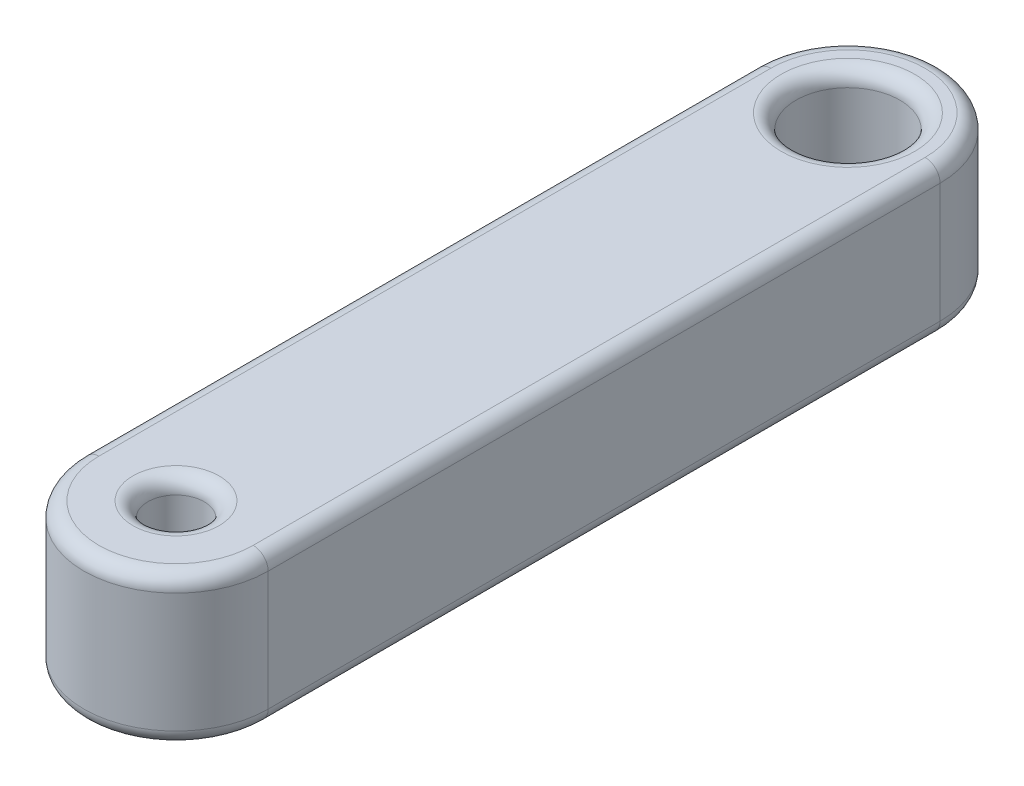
ISO-10303-21;
HEADER;
FILE_DESCRIPTION(('STEP AP214'),'2;1');
FILE_NAME('part.step','',(''),(''),'','','');
FILE_SCHEMA(('AUTOMOTIVE_DESIGN { 1 0 10303 214 1 1 1 1 }'));
ENDSEC;
DATA;
#1=APPLICATION_CONTEXT('core data for automotive mechanical design processes');
#2=APPLICATION_PROTOCOL_DEFINITION('international standard','automotive_design',2000,#1);
#3=PRODUCT_CONTEXT('',#1,'mechanical');
#4=PRODUCT('Part','Part','',(#3));
#5=PRODUCT_RELATED_PRODUCT_CATEGORY('part','',(#4));
#6=PRODUCT_DEFINITION_FORMATION('','',#4);
#7=PRODUCT_DEFINITION_CONTEXT('part definition',#1,'design');
#8=PRODUCT_DEFINITION('design','',#6,#7);
#9=PRODUCT_DEFINITION_SHAPE('','',#8);
#10=(LENGTH_UNIT() NAMED_UNIT(*) SI_UNIT(.MILLI.,.METRE.));
#11=(NAMED_UNIT(*) PLANE_ANGLE_UNIT() SI_UNIT($,.RADIAN.));
#12=(NAMED_UNIT(*) SI_UNIT($,.STERADIAN.) SOLID_ANGLE_UNIT());
#13=UNCERTAINTY_MEASURE_WITH_UNIT(LENGTH_MEASURE(1.E-05),#10,'distance_accuracy_value','');
#14=(GEOMETRIC_REPRESENTATION_CONTEXT(3) GLOBAL_UNCERTAINTY_ASSIGNED_CONTEXT((#13)) GLOBAL_UNIT_ASSIGNED_CONTEXT((#10,
#11,#12)) REPRESENTATION_CONTEXT('',''));
#15=CARTESIAN_POINT('',(0.,0.,0.));
#16=DIRECTION('',(0.,0.,1.));
#17=DIRECTION('',(1.,0.,0.));
#18=AXIS2_PLACEMENT_3D('',#15,#16,#17);
#19=CARTESIAN_POINT('',(0.,10.,0.));
#20=DIRECTION('',(0.,1.,0.));
#21=DIRECTION('',(0.,0.,1.));
#22=AXIS2_PLACEMENT_3D('',#19,#20,#21);
#23=PLANE('',#22);
#24=CARTESIAN_POINT('',(0.,10.,45.));
#25=DIRECTION('',(0.,1.,0.));
#26=DIRECTION('',(0.,0.,1.));
#27=AXIS2_PLACEMENT_3D('',#24,#25,#26);
#28=CIRCLE('',#27,2.8875);
#29=CARTESIAN_POINT('',(0.,10.,47.8875));
#30=VERTEX_POINT('',#29);
#31=EDGE_CURVE('E11',#30,#30,#28,.F.);
#32=ORIENTED_EDGE('',*,*,#31,.T.);
#33=EDGE_LOOP('',(#32));
#34=FACE_BOUND('',#33,.T.);
#35=CARTESIAN_POINT('',(0.,10.,45.));
#36=DIRECTION('',(0.,1.,0.));
#37=DIRECTION('',(0.,0.,1.));
#38=AXIS2_PLACEMENT_3D('',#35,#36,#37);
#39=CIRCLE('',#38,5.16883116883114);
#40=CARTESIAN_POINT('',(-5.16883116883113,10.,45.));
#41=VERTEX_POINT('',#40);
#42=CARTESIAN_POINT('',(5.16883116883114,10.,45.));
#43=VERTEX_POINT('',#42);
#44=EDGE_CURVE('E51',#41,#43,#39,.T.);
#45=ORIENTED_EDGE('',*,*,#44,.T.);
#46=DIRECTION('',(0.,0.,-1.));
#47=VECTOR('',#46,1.);
#48=CARTESIAN_POINT('',(5.16883116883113,10.,0.));
#49=LINE('',#48,#47);
#50=CARTESIAN_POINT('',(5.16883116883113,10.,0.));
#51=VERTEX_POINT('',#50);
#52=EDGE_CURVE('E43',#43,#51,#49,.T.);
#53=ORIENTED_EDGE('',*,*,#52,.T.);
#54=CARTESIAN_POINT('',(0.,10.,0.));
#55=DIRECTION('',(0.,1.,0.));
#56=DIRECTION('',(0.,0.,1.));
#57=AXIS2_PLACEMENT_3D('',#54,#55,#56);
#58=CIRCLE('',#57,5.16883116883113);
#59=CARTESIAN_POINT('',(-5.16883116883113,10.,0.));
#60=VERTEX_POINT('',#59);
#61=EDGE_CURVE('E169',#51,#60,#58,.T.);
#62=ORIENTED_EDGE('',*,*,#61,.T.);
#63=DIRECTION('',(0.,0.,1.));
#64=VECTOR('',#63,1.);
#65=CARTESIAN_POINT('',(-5.16883116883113,10.,45.));
#66=LINE('',#65,#64);
#67=EDGE_CURVE('E56',#60,#41,#66,.T.);
#68=ORIENTED_EDGE('',*,*,#67,.T.);
#69=EDGE_LOOP('',(#45,#53,#62,#68));
#70=FACE_BOUND('',#69,.T.);
#71=CARTESIAN_POINT('',(0.,10.,0.));
#72=DIRECTION('',(0.,1.,0.));
#73=DIRECTION('',(0.,0.,1.));
#74=AXIS2_PLACEMENT_3D('',#71,#72,#73);
#75=CIRCLE('',#74,4.475);
#76=CARTESIAN_POINT('',(0.,10.,4.475));
#77=VERTEX_POINT('',#76);
#78=EDGE_CURVE('E166',#77,#77,#75,.F.);
#79=ORIENTED_EDGE('',*,*,#78,.T.);
#80=EDGE_LOOP('',(#79));
#81=FACE_BOUND('',#80,.T.);
#82=ADVANCED_FACE('F34',(#34,#70,#81),#23,.T.);
#83=CARTESIAN_POINT('',(0.,0.,0.));
#84=DIRECTION('',(0.,1.,0.));
#85=DIRECTION('',(0.,0.,1.));
#86=AXIS2_PLACEMENT_3D('',#83,#84,#85);
#87=PLANE('',#86);
#88=CARTESIAN_POINT('',(0.,0.,45.));
#89=DIRECTION('',(0.,1.,0.));
#90=DIRECTION('',(0.,0.,1.));
#91=AXIS2_PLACEMENT_3D('',#88,#89,#90);
#92=CIRCLE('',#91,2.8875);
#93=CARTESIAN_POINT('',(0.,0.,47.8875));
#94=VERTEX_POINT('',#93);
#95=EDGE_CURVE('E131',#94,#94,#92,.T.);
#96=ORIENTED_EDGE('',*,*,#95,.T.);
#97=EDGE_LOOP('',(#96));
#98=FACE_BOUND('',#97,.T.);
#99=CARTESIAN_POINT('',(0.,0.,0.));
#100=DIRECTION('',(0.,1.,0.));
#101=DIRECTION('',(0.,0.,1.));
#102=AXIS2_PLACEMENT_3D('',#99,#100,#101);
#103=CIRCLE('',#102,4.475);
#104=CARTESIAN_POINT('',(0.,0.,4.475));
#105=VERTEX_POINT('',#104);
#106=EDGE_CURVE('E128',#105,#105,#103,.T.);
#107=ORIENTED_EDGE('',*,*,#106,.T.);
#108=EDGE_LOOP('',(#107));
#109=FACE_BOUND('',#108,.T.);
#110=CARTESIAN_POINT('',(0.,0.,45.));
#111=DIRECTION('',(0.,1.,0.));
#112=DIRECTION('',(0.,0.,1.));
#113=AXIS2_PLACEMENT_3D('',#110,#111,#112);
#114=CIRCLE('',#113,5.16883116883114);
#115=CARTESIAN_POINT('',(5.16883116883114,0.,45.));
#116=VERTEX_POINT('',#115);
#117=CARTESIAN_POINT('',(-5.16883116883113,0.,45.));
#118=VERTEX_POINT('',#117);
#119=EDGE_CURVE('E127',#116,#118,#114,.F.);
#120=ORIENTED_EDGE('',*,*,#119,.T.);
#121=DIRECTION('',(0.,0.,1.));
#122=VECTOR('',#121,1.);
#123=CARTESIAN_POINT('',(-5.16883116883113,0.,0.));
#124=LINE('',#123,#122);
#125=CARTESIAN_POINT('',(-5.16883116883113,0.,0.));
#126=VERTEX_POINT('',#125);
#127=EDGE_CURVE('E106',#118,#126,#124,.F.);
#128=ORIENTED_EDGE('',*,*,#127,.T.);
#129=CARTESIAN_POINT('',(0.,0.,0.));
#130=DIRECTION('',(0.,1.,0.));
#131=DIRECTION('',(0.,0.,1.));
#132=AXIS2_PLACEMENT_3D('',#129,#130,#131);
#133=CIRCLE('',#132,5.16883116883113);
#134=CARTESIAN_POINT('',(5.16883116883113,0.,0.));
#135=VERTEX_POINT('',#134);
#136=EDGE_CURVE('E116',#126,#135,#133,.F.);
#137=ORIENTED_EDGE('',*,*,#136,.T.);
#138=DIRECTION('',(0.,0.,-1.));
#139=VECTOR('',#138,1.);
#140=CARTESIAN_POINT('',(5.16883116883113,0.,0.));
#141=LINE('',#140,#139);
#142=EDGE_CURVE('E122',#135,#116,#141,.F.);
#143=ORIENTED_EDGE('',*,*,#142,.T.);
#144=EDGE_LOOP('',(#120,#128,#137,#143));
#145=FACE_BOUND('',#144,.T.);
#146=ADVANCED_FACE('F125',(#98,#109,#145),#87,.F.);
#147=CARTESIAN_POINT('',(0.,10.,0.));
#148=DIRECTION('',(0.,-1.,0.));
#149=DIRECTION('',(0.,0.,-1.));
#150=AXIS2_PLACEMENT_3D('',#147,#148,#149);
#151=CYLINDRICAL_SURFACE('',#150,6.16883116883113);
#152=DIRECTION('',(0.,-1.,0.));
#153=VECTOR('',#152,1.);
#154=CARTESIAN_POINT('',(6.16883116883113,10.,0.));
#155=LINE('',#154,#153);
#156=CARTESIAN_POINT('',(6.16883116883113,9.,0.));
#157=VERTEX_POINT('',#156);
#158=CARTESIAN_POINT('',(6.16883116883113,0.999999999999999,0.));
#159=VERTEX_POINT('',#158);
#160=EDGE_CURVE('E178',#157,#159,#155,.T.);
#161=ORIENTED_EDGE('',*,*,#160,.T.);
#162=CARTESIAN_POINT('',(0.,0.999999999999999,0.));
#163=DIRECTION('',(0.,1.,0.));
#164=DIRECTION('',(0.,0.,1.));
#165=AXIS2_PLACEMENT_3D('',#162,#163,#164);
#166=CIRCLE('',#165,6.16883116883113);
#167=CARTESIAN_POINT('',(-6.16883116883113,0.999999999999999,0.));
#168=VERTEX_POINT('',#167);
#169=EDGE_CURVE('E164',#159,#168,#166,.T.);
#170=ORIENTED_EDGE('',*,*,#169,.T.);
#171=DIRECTION('',(0.,-1.,0.));
#172=VECTOR('',#171,1.);
#173=CARTESIAN_POINT('',(-6.16883116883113,10.,0.));
#174=LINE('',#173,#172);
#175=CARTESIAN_POINT('',(-6.16883116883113,9.,0.));
#176=VERTEX_POINT('',#175);
#177=EDGE_CURVE('E123',#176,#168,#174,.T.);
#178=ORIENTED_EDGE('',*,*,#177,.F.);
#179=CARTESIAN_POINT('',(0.,9.,0.));
#180=DIRECTION('',(0.,1.,0.));
#181=DIRECTION('',(0.,0.,1.));
#182=AXIS2_PLACEMENT_3D('',#179,#180,#181);
#183=CIRCLE('',#182,6.16883116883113);
#184=EDGE_CURVE('E162',#176,#157,#183,.F.);
#185=ORIENTED_EDGE('',*,*,#184,.T.);
#186=EDGE_LOOP('',(#161,#170,#178,#185));
#187=FACE_BOUND('',#186,.T.);
#188=ADVANCED_FACE('F204',(#187),#151,.T.);
#189=CARTESIAN_POINT('',(-6.16883116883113,10.,0.));
#190=DIRECTION('',(1.,0.,0.));
#191=DIRECTION('',(0.,0.,-1.));
#192=AXIS2_PLACEMENT_3D('',#189,#190,#191);
#193=PLANE('',#192);
#194=ORIENTED_EDGE('',*,*,#177,.T.);
#195=DIRECTION('',(0.,0.,1.));
#196=VECTOR('',#195,1.);
#197=CARTESIAN_POINT('',(-6.16883116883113,0.999999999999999,0.));
#198=LINE('',#197,#196);
#199=CARTESIAN_POINT('',(-6.16883116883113,0.999999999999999,45.));
#200=VERTEX_POINT('',#199);
#201=EDGE_CURVE('E109',#168,#200,#198,.T.);
#202=ORIENTED_EDGE('',*,*,#201,.T.);
#203=DIRECTION('',(0.,-1.,0.));
#204=VECTOR('',#203,1.);
#205=CARTESIAN_POINT('',(-6.16883116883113,10.,45.));
#206=LINE('',#205,#204);
#207=CARTESIAN_POINT('',(-6.16883116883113,9.,45.));
#208=VERTEX_POINT('',#207);
#209=EDGE_CURVE('E201',#208,#200,#206,.T.);
#210=ORIENTED_EDGE('',*,*,#209,.F.);
#211=DIRECTION('',(0.,0.,1.));
#212=VECTOR('',#211,1.);
#213=CARTESIAN_POINT('',(-6.16883116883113,9.,0.));
#214=LINE('',#213,#212);
#215=EDGE_CURVE('E150',#208,#176,#214,.F.);
#216=ORIENTED_EDGE('',*,*,#215,.T.);
#217=EDGE_LOOP('',(#194,#202,#210,#216));
#218=FACE_BOUND('',#217,.T.);
#219=ADVANCED_FACE('F199',(#218),#193,.F.);
#220=CARTESIAN_POINT('',(0.,10.,45.));
#221=DIRECTION('',(0.,-1.,0.));
#222=DIRECTION('',(0.,0.,-1.));
#223=AXIS2_PLACEMENT_3D('',#220,#221,#222);
#224=CYLINDRICAL_SURFACE('',#223,6.16883116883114);
#225=ORIENTED_EDGE('',*,*,#209,.T.);
#226=CARTESIAN_POINT('',(0.,0.999999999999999,45.));
#227=DIRECTION('',(0.,1.,0.));
#228=DIRECTION('',(0.,0.,1.));
#229=AXIS2_PLACEMENT_3D('',#226,#227,#228);
#230=CIRCLE('',#229,6.16883116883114);
#231=CARTESIAN_POINT('',(6.16883116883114,0.999999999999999,45.));
#232=VERTEX_POINT('',#231);
#233=EDGE_CURVE('E155',#200,#232,#230,.T.);
#234=ORIENTED_EDGE('',*,*,#233,.T.);
#235=DIRECTION('',(0.,-1.,0.));
#236=VECTOR('',#235,1.);
#237=CARTESIAN_POINT('',(6.16883116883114,10.,45.));
#238=LINE('',#237,#236);
#239=CARTESIAN_POINT('',(6.16883116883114,9.,45.));
#240=VERTEX_POINT('',#239);
#241=EDGE_CURVE('E207',#240,#232,#238,.T.);
#242=ORIENTED_EDGE('',*,*,#241,.F.);
#243=CARTESIAN_POINT('',(0.,9.,45.));
#244=DIRECTION('',(0.,1.,0.));
#245=DIRECTION('',(0.,0.,1.));
#246=AXIS2_PLACEMENT_3D('',#243,#244,#245);
#247=CIRCLE('',#246,6.16883116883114);
#248=EDGE_CURVE('E153',#240,#208,#247,.F.);
#249=ORIENTED_EDGE('',*,*,#248,.T.);
#250=EDGE_LOOP('',(#225,#234,#242,#249));
#251=FACE_BOUND('',#250,.T.);
#252=ADVANCED_FACE('F220',(#251),#224,.T.);
#253=CARTESIAN_POINT('',(6.16883116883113,10.,0.));
#254=DIRECTION('',(-1.,0.,0.));
#255=DIRECTION('',(0.,0.,1.));
#256=AXIS2_PLACEMENT_3D('',#253,#254,#255);
#257=PLANE('',#256);
#258=ORIENTED_EDGE('',*,*,#241,.T.);
#259=DIRECTION('',(0.,0.,-1.));
#260=VECTOR('',#259,1.);
#261=CARTESIAN_POINT('',(6.16883116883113,0.999999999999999,0.));
#262=LINE('',#261,#260);
#263=EDGE_CURVE('E160',#232,#159,#262,.T.);
#264=ORIENTED_EDGE('',*,*,#263,.T.);
#265=ORIENTED_EDGE('',*,*,#160,.F.);
#266=DIRECTION('',(0.,0.,-1.));
#267=VECTOR('',#266,1.);
#268=CARTESIAN_POINT('',(6.16883116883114,9.,45.));
#269=LINE('',#268,#267);
#270=EDGE_CURVE('E157',#157,#240,#269,.F.);
#271=ORIENTED_EDGE('',*,*,#270,.T.);
#272=EDGE_LOOP('',(#258,#264,#265,#271));
#273=FACE_BOUND('',#272,.T.);
#274=ADVANCED_FACE('F224',(#273),#257,.F.);
#275=CARTESIAN_POINT('',(0.,10.,0.));
#276=DIRECTION('',(0.,-1.,0.));
#277=DIRECTION('',(0.,0.,-1.));
#278=AXIS2_PLACEMENT_3D('',#275,#276,#277);
#279=CYLINDRICAL_SURFACE('',#278,3.475);
#280=CARTESIAN_POINT('',(0.,0.999999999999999,0.));
#281=DIRECTION('',(0.,1.,0.));
#282=DIRECTION('',(0.,0.,1.));
#283=AXIS2_PLACEMENT_3D('',#280,#281,#282);
#284=CIRCLE('',#283,3.475);
#285=CARTESIAN_POINT('',(0.,0.999999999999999,3.475));
#286=VERTEX_POINT('',#285);
#287=EDGE_CURVE('E147',#286,#286,#284,.F.);
#288=ORIENTED_EDGE('',*,*,#287,.T.);
#289=EDGE_LOOP('',(#288));
#290=FACE_BOUND('',#289,.T.);
#291=CARTESIAN_POINT('',(0.,9.,0.));
#292=DIRECTION('',(0.,1.,0.));
#293=DIRECTION('',(0.,0.,1.));
#294=AXIS2_PLACEMENT_3D('',#291,#292,#293);
#295=CIRCLE('',#294,3.475);
#296=CARTESIAN_POINT('',(0.,9.,3.475));
#297=VERTEX_POINT('',#296);
#298=EDGE_CURVE('E144',#297,#297,#295,.T.);
#299=ORIENTED_EDGE('',*,*,#298,.T.);
#300=EDGE_LOOP('',(#299));
#301=FACE_BOUND('',#300,.T.);
#302=ADVANCED_FACE('F240',(#290,#301),#279,.F.);
#303=CARTESIAN_POINT('',(0.,10.,45.));
#304=DIRECTION('',(0.,-1.,0.));
#305=DIRECTION('',(0.,0.,-1.));
#306=AXIS2_PLACEMENT_3D('',#303,#304,#305);
#307=CYLINDRICAL_SURFACE('',#306,1.8875);
#308=CARTESIAN_POINT('',(0.,0.999999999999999,45.));
#309=DIRECTION('',(0.,1.,0.));
#310=DIRECTION('',(0.,0.,1.));
#311=AXIS2_PLACEMENT_3D('',#308,#309,#310);
#312=CIRCLE('',#311,1.8875);
#313=CARTESIAN_POINT('',(0.,0.999999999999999,46.8875));
#314=VERTEX_POINT('',#313);
#315=EDGE_CURVE('E141',#314,#314,#312,.F.);
#316=ORIENTED_EDGE('',*,*,#315,.T.);
#317=EDGE_LOOP('',(#316));
#318=FACE_BOUND('',#317,.T.);
#319=CARTESIAN_POINT('',(0.,9.,45.));
#320=DIRECTION('',(0.,1.,0.));
#321=DIRECTION('',(0.,0.,1.));
#322=AXIS2_PLACEMENT_3D('',#319,#320,#321);
#323=CIRCLE('',#322,1.8875);
#324=CARTESIAN_POINT('',(0.,9.,46.8875));
#325=VERTEX_POINT('',#324);
#326=EDGE_CURVE('E138',#325,#325,#323,.T.);
#327=ORIENTED_EDGE('',*,*,#326,.T.);
#328=EDGE_LOOP('',(#327));
#329=FACE_BOUND('',#328,.T.);
#330=ADVANCED_FACE('F242',(#318,#329),#307,.F.);
#331=CARTESIAN_POINT('',(0.,0.999999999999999,45.));
#332=DIRECTION('',(0.,1.,0.));
#333=DIRECTION('',(0.,0.,1.));
#334=AXIS2_PLACEMENT_3D('',#331,#332,#333);
#335=TOROIDAL_SURFACE('',#334,2.8875,1.);
#336=ORIENTED_EDGE('',*,*,#315,.F.);
#337=EDGE_LOOP('',(#336));
#338=FACE_BOUND('',#337,.T.);
#339=ORIENTED_EDGE('',*,*,#95,.F.);
#340=EDGE_LOOP('',(#339));
#341=FACE_BOUND('',#340,.T.);
#342=ADVANCED_FACE('F249',(#338,#341),#335,.T.);
#343=CARTESIAN_POINT('',(0.,0.999999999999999,0.));
#344=DIRECTION('',(0.,1.,0.));
#345=DIRECTION('',(0.,0.,1.));
#346=AXIS2_PLACEMENT_3D('',#343,#344,#345);
#347=TOROIDAL_SURFACE('',#346,4.475,1.);
#348=ORIENTED_EDGE('',*,*,#287,.F.);
#349=EDGE_LOOP('',(#348));
#350=FACE_BOUND('',#349,.T.);
#351=ORIENTED_EDGE('',*,*,#106,.F.);
#352=EDGE_LOOP('',(#351));
#353=FACE_BOUND('',#352,.T.);
#354=ADVANCED_FACE('F265',(#350,#353),#347,.T.);
#355=CARTESIAN_POINT('',(5.16883116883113,0.999999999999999,0.));
#356=DIRECTION('',(0.,0.,-1.));
#357=DIRECTION('',(-1.,0.,0.));
#358=AXIS2_PLACEMENT_3D('',#355,#356,#357);
#359=CYLINDRICAL_SURFACE('',#358,1.);
#360=CARTESIAN_POINT('',(5.16883116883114,1.,45.));
#361=DIRECTION('',(0.,0.,1.));
#362=DIRECTION('',(1.,0.,0.));
#363=AXIS2_PLACEMENT_3D('',#360,#361,#362);
#364=CIRCLE('',#363,1.);
#365=EDGE_CURVE('E112',#116,#232,#364,.T.);
#366=ORIENTED_EDGE('',*,*,#365,.F.);
#367=ORIENTED_EDGE('',*,*,#142,.F.);
#368=CARTESIAN_POINT('',(5.16883116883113,0.999999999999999,0.));
#369=DIRECTION('',(0.,0.,-1.));
#370=DIRECTION('',(-1.,0.,0.));
#371=AXIS2_PLACEMENT_3D('',#368,#369,#370);
#372=CIRCLE('',#371,1.);
#373=EDGE_CURVE('E119',#159,#135,#372,.T.);
#374=ORIENTED_EDGE('',*,*,#373,.F.);
#375=ORIENTED_EDGE('',*,*,#263,.F.);
#376=EDGE_LOOP('',(#366,#367,#374,#375));
#377=FACE_BOUND('',#376,.T.);
#378=ADVANCED_FACE('F213',(#377),#359,.T.);
#379=CARTESIAN_POINT('',(0.,0.999999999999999,0.));
#380=DIRECTION('',(0.,1.,0.));
#381=DIRECTION('',(0.,0.,1.));
#382=AXIS2_PLACEMENT_3D('',#379,#380,#381);
#383=TOROIDAL_SURFACE('',#382,5.16883116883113,1.);
#384=ORIENTED_EDGE('',*,*,#373,.T.);
#385=ORIENTED_EDGE('',*,*,#136,.F.);
#386=CARTESIAN_POINT('',(-5.16883116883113,0.999999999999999,0.));
#387=DIRECTION('',(0.,0.,1.));
#388=DIRECTION('',(0.,-1.,0.));
#389=AXIS2_PLACEMENT_3D('',#386,#387,#388);
#390=CIRCLE('',#389,1.);
#391=EDGE_CURVE('E102',#168,#126,#390,.T.);
#392=ORIENTED_EDGE('',*,*,#391,.F.);
#393=ORIENTED_EDGE('',*,*,#169,.F.);
#394=EDGE_LOOP('',(#384,#385,#392,#393));
#395=FACE_BOUND('',#394,.T.);
#396=ADVANCED_FACE('F117',(#395),#383,.T.);
#397=CARTESIAN_POINT('',(0.,0.999999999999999,45.));
#398=DIRECTION('',(0.,1.,0.));
#399=DIRECTION('',(0.,0.,1.));
#400=AXIS2_PLACEMENT_3D('',#397,#398,#399);
#401=TOROIDAL_SURFACE('',#400,5.16883116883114,1.);
#402=ORIENTED_EDGE('',*,*,#365,.T.);
#403=ORIENTED_EDGE('',*,*,#233,.F.);
#404=CARTESIAN_POINT('',(-5.16883116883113,1.,45.));
#405=DIRECTION('',(0.,0.,-1.));
#406=DIRECTION('',(-1.,0.,0.));
#407=AXIS2_PLACEMENT_3D('',#404,#405,#406);
#408=CIRCLE('',#407,1.);
#409=EDGE_CURVE('E113',#118,#200,#408,.T.);
#410=ORIENTED_EDGE('',*,*,#409,.F.);
#411=ORIENTED_EDGE('',*,*,#119,.F.);
#412=EDGE_LOOP('',(#402,#403,#410,#411));
#413=FACE_BOUND('',#412,.T.);
#414=ADVANCED_FACE('F216',(#413),#401,.T.);
#415=CARTESIAN_POINT('',(-5.16883116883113,0.999999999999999,0.));
#416=DIRECTION('',(0.,0.,1.));
#417=DIRECTION('',(1.,0.,0.));
#418=AXIS2_PLACEMENT_3D('',#415,#416,#417);
#419=CYLINDRICAL_SURFACE('',#418,1.);
#420=ORIENTED_EDGE('',*,*,#391,.T.);
#421=ORIENTED_EDGE('',*,*,#127,.F.);
#422=ORIENTED_EDGE('',*,*,#409,.T.);
#423=ORIENTED_EDGE('',*,*,#201,.F.);
#424=EDGE_LOOP('',(#420,#421,#422,#423));
#425=FACE_BOUND('',#424,.T.);
#426=ADVANCED_FACE('F104',(#425),#419,.T.);
#427=CARTESIAN_POINT('',(0.,9.,45.));
#428=DIRECTION('',(0.,1.,0.));
#429=DIRECTION('',(0.,0.,1.));
#430=AXIS2_PLACEMENT_3D('',#427,#428,#429);
#431=TOROIDAL_SURFACE('',#430,2.8875,1.);
#432=ORIENTED_EDGE('',*,*,#31,.F.);
#433=EDGE_LOOP('',(#432));
#434=FACE_BOUND('',#433,.T.);
#435=ORIENTED_EDGE('',*,*,#326,.F.);
#436=EDGE_LOOP('',(#435));
#437=FACE_BOUND('',#436,.T.);
#438=ADVANCED_FACE('F272',(#434,#437),#431,.T.);
#439=CARTESIAN_POINT('',(-5.16883116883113,9.,0.));
#440=DIRECTION('',(0.,0.,-1.));
#441=DIRECTION('',(-1.,0.,0.));
#442=AXIS2_PLACEMENT_3D('',#439,#440,#441);
#443=CYLINDRICAL_SURFACE('',#442,1.);
#444=CARTESIAN_POINT('',(-5.16883116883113,9.,0.));
#445=DIRECTION('',(0.,0.,-1.));
#446=DIRECTION('',(-1.,0.,0.));
#447=AXIS2_PLACEMENT_3D('',#444,#445,#446);
#448=CIRCLE('',#447,1.);
#449=EDGE_CURVE('E182',#176,#60,#448,.T.);
#450=ORIENTED_EDGE('',*,*,#449,.F.);
#451=ORIENTED_EDGE('',*,*,#215,.F.);
#452=CARTESIAN_POINT('',(-5.16883116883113,9.,45.));
#453=DIRECTION('',(0.,0.,1.));
#454=DIRECTION('',(1.,0.,0.));
#455=AXIS2_PLACEMENT_3D('',#452,#453,#454);
#456=CIRCLE('',#455,1.);
#457=EDGE_CURVE('E38',#41,#208,#456,.T.);
#458=ORIENTED_EDGE('',*,*,#457,.F.);
#459=ORIENTED_EDGE('',*,*,#67,.F.);
#460=EDGE_LOOP('',(#450,#451,#458,#459));
#461=FACE_BOUND('',#460,.T.);
#462=ADVANCED_FACE('F194',(#461),#443,.T.);
#463=CARTESIAN_POINT('',(0.,9.,45.));
#464=DIRECTION('',(0.,1.,0.));
#465=DIRECTION('',(0.,0.,1.));
#466=AXIS2_PLACEMENT_3D('',#463,#464,#465);
#467=TOROIDAL_SURFACE('',#466,5.16883116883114,1.);
#468=ORIENTED_EDGE('',*,*,#457,.T.);
#469=ORIENTED_EDGE('',*,*,#248,.F.);
#470=CARTESIAN_POINT('',(5.16883116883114,9.,45.));
#471=DIRECTION('',(0.,0.,-1.));
#472=DIRECTION('',(-1.,0.,0.));
#473=AXIS2_PLACEMENT_3D('',#470,#471,#472);
#474=CIRCLE('',#473,1.);
#475=EDGE_CURVE('E181',#43,#240,#474,.T.);
#476=ORIENTED_EDGE('',*,*,#475,.F.);
#477=ORIENTED_EDGE('',*,*,#44,.F.);
#478=EDGE_LOOP('',(#468,#469,#476,#477));
#479=FACE_BOUND('',#478,.T.);
#480=ADVANCED_FACE('F191',(#479),#467,.T.);
#481=CARTESIAN_POINT('',(0.,9.,0.));
#482=DIRECTION('',(0.,1.,0.));
#483=DIRECTION('',(0.,0.,1.));
#484=AXIS2_PLACEMENT_3D('',#481,#482,#483);
#485=TOROIDAL_SURFACE('',#484,5.16883116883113,1.);
#486=ORIENTED_EDGE('',*,*,#449,.T.);
#487=ORIENTED_EDGE('',*,*,#61,.F.);
#488=CARTESIAN_POINT('',(5.16883116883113,9.,0.));
#489=DIRECTION('',(0.,0.,1.));
#490=DIRECTION('',(0.,-1.,0.));
#491=AXIS2_PLACEMENT_3D('',#488,#489,#490);
#492=CIRCLE('',#491,1.);
#493=EDGE_CURVE('E179',#157,#51,#492,.T.);
#494=ORIENTED_EDGE('',*,*,#493,.F.);
#495=ORIENTED_EDGE('',*,*,#184,.F.);
#496=EDGE_LOOP('',(#486,#487,#494,#495));
#497=FACE_BOUND('',#496,.T.);
#498=ADVANCED_FACE('F229',(#497),#485,.T.);
#499=CARTESIAN_POINT('',(5.16883116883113,9.,0.));
#500=DIRECTION('',(0.,0.,1.));
#501=DIRECTION('',(1.,0.,0.));
#502=AXIS2_PLACEMENT_3D('',#499,#500,#501);
#503=CYLINDRICAL_SURFACE('',#502,1.);
#504=ORIENTED_EDGE('',*,*,#475,.T.);
#505=ORIENTED_EDGE('',*,*,#270,.F.);
#506=ORIENTED_EDGE('',*,*,#493,.T.);
#507=ORIENTED_EDGE('',*,*,#52,.F.);
#508=EDGE_LOOP('',(#504,#505,#506,#507));
#509=FACE_BOUND('',#508,.T.);
#510=ADVANCED_FACE('F227',(#509),#503,.T.);
#511=CARTESIAN_POINT('',(0.,9.,0.));
#512=DIRECTION('',(0.,1.,0.));
#513=DIRECTION('',(0.,0.,1.));
#514=AXIS2_PLACEMENT_3D('',#511,#512,#513);
#515=TOROIDAL_SURFACE('',#514,4.475,1.);
#516=ORIENTED_EDGE('',*,*,#78,.F.);
#517=EDGE_LOOP('',(#516));
#518=FACE_BOUND('',#517,.T.);
#519=ORIENTED_EDGE('',*,*,#298,.F.);
#520=EDGE_LOOP('',(#519));
#521=FACE_BOUND('',#520,.T.);
#522=ADVANCED_FACE('F36',(#518,#521),#515,.T.);
#523=CLOSED_SHELL('',(#82,#146,#188,#219,#252,#274,#302,#330,#342,#354,#378,#396,#414,#426,#438,
#462,#480,#498,#510,#522));
#524=MANIFOLD_SOLID_BREP('B2',#523);
#525=ADVANCED_BREP_SHAPE_REPRESENTATION('',(#18,#524),#14);
#526=SHAPE_DEFINITION_REPRESENTATION(#9,#525);
ENDSEC;
END-ISO-10303-21;
